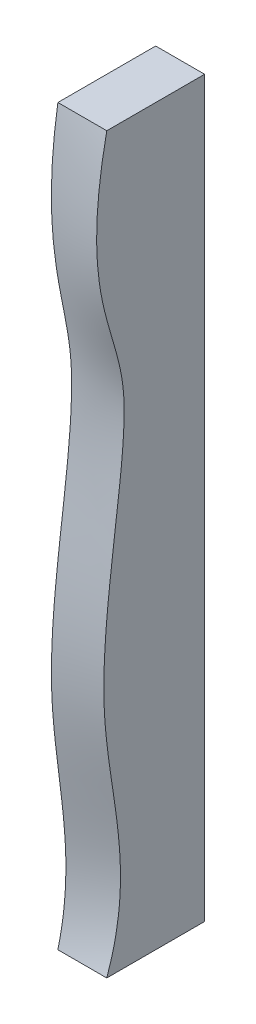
ISO-10303-21;
HEADER;
FILE_DESCRIPTION(('STEP AP214'),'2;1');
FILE_NAME('part.step','',(''),(''),'','','');
FILE_SCHEMA(('AUTOMOTIVE_DESIGN { 1 0 10303 214 1 1 1 1 }'));
ENDSEC;
DATA;
#1=APPLICATION_CONTEXT('core data for automotive mechanical design processes');
#2=APPLICATION_PROTOCOL_DEFINITION('international standard','automotive_design',2000,#1);
#3=PRODUCT_CONTEXT('',#1,'mechanical');
#4=PRODUCT('Part','Part','',(#3));
#5=PRODUCT_RELATED_PRODUCT_CATEGORY('part','',(#4));
#6=PRODUCT_DEFINITION_FORMATION('','',#4);
#7=PRODUCT_DEFINITION_CONTEXT('part definition',#1,'design');
#8=PRODUCT_DEFINITION('design','',#6,#7);
#9=PRODUCT_DEFINITION_SHAPE('','',#8);
#10=(LENGTH_UNIT() NAMED_UNIT(*) SI_UNIT(.MILLI.,.METRE.));
#11=(NAMED_UNIT(*) PLANE_ANGLE_UNIT() SI_UNIT($,.RADIAN.));
#12=(NAMED_UNIT(*) SI_UNIT($,.STERADIAN.) SOLID_ANGLE_UNIT());
#13=UNCERTAINTY_MEASURE_WITH_UNIT(LENGTH_MEASURE(1.E-05),#10,'distance_accuracy_value','');
#14=(GEOMETRIC_REPRESENTATION_CONTEXT(3) GLOBAL_UNCERTAINTY_ASSIGNED_CONTEXT((#13)) GLOBAL_UNIT_ASSIGNED_CONTEXT((#10,
#11,#12)) REPRESENTATION_CONTEXT('',''));
#15=CARTESIAN_POINT('',(0.,0.,0.));
#16=DIRECTION('',(0.,0.,1.));
#17=DIRECTION('',(1.,0.,0.));
#18=AXIS2_PLACEMENT_3D('',#15,#16,#17);
#19=CARTESIAN_POINT('',(-550.,375.,253.120113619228));
#20=DIRECTION('',(1.,0.,0.));
#21=DIRECTION('',(0.,0.,-1.));
#22=AXIS2_PLACEMENT_3D('',#19,#20,#21);
#23=PLANE('',#22);
#24=CARTESIAN_POINT('',(-550.,375.,100.));
#25=CARTESIAN_POINT('',(-550.,373.012969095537,100.416027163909));
#26=CARTESIAN_POINT('',(-550.,371.023877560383,100.822256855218));
#27=CARTESIAN_POINT('',(-550.,367.041408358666,101.614320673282));
#28=CARTESIAN_POINT('',(-550.,365.0480302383,102.000152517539));
#29=CARTESIAN_POINT('',(-550.,361.057166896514,102.750545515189));
#30=CARTESIAN_POINT('',(-550.,359.059681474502,103.115105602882));
#31=CARTESIAN_POINT('',(-550.,355.060777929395,103.822017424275));
#32=CARTESIAN_POINT('',(-550.,353.059359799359,104.164369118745));
#33=CARTESIAN_POINT('',(-550.,349.052754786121,104.825877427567));
#34=CARTESIAN_POINT('',(-550.,347.04756802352,105.145034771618));
#35=CARTESIAN_POINT('',(-550.,343.033579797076,105.759108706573));
#36=CARTESIAN_POINT('',(-550.,341.024778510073,106.054026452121));
#37=CARTESIAN_POINT('',(-550.,336.994968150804,106.619739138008));
#38=CARTESIAN_POINT('',(-550.,334.973943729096,106.890424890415));
#39=CARTESIAN_POINT('',(-550.,330.928505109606,107.405036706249));
#40=CARTESIAN_POINT('',(-550.,328.904090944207,107.648963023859));
#41=CARTESIAN_POINT('',(-550.,324.851993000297,108.108788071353));
#42=CARTESIAN_POINT('',(-550.,322.824309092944,108.32468566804));
#43=CARTESIAN_POINT('',(-550.,318.76578497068,108.727105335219));
#44=CARTESIAN_POINT('',(-550.,316.734944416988,108.913623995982));
#45=CARTESIAN_POINT('',(-550.,312.670208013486,109.255854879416));
#46=CARTESIAN_POINT('',(-550.,310.636311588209,109.411560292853));
#47=CARTESIAN_POINT('',(-550.,306.56557054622,109.69064719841));
#48=CARTESIAN_POINT('',(-550.,304.528725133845,109.814017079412));
#49=CARTESIAN_POINT('',(-550.,299.714061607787,110.065366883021));
#50=CARTESIAN_POINT('',(-550.,296.935464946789,110.178786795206));
#51=CARTESIAN_POINT('',(-550.,291.37566134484,110.338376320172));
#52=CARTESIAN_POINT('',(-550.,288.594453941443,110.384529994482));
#53=CARTESIAN_POINT('',(-550.,283.031982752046,110.40527152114));
#54=CARTESIAN_POINT('',(-550.,280.25071899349,110.379865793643));
#55=CARTESIAN_POINT('',(-550.,274.690705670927,110.253330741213));
#56=CARTESIAN_POINT('',(-550.,271.911955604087,110.152224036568));
#57=CARTESIAN_POINT('',(-550.,266.359554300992,109.870508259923));
#58=CARTESIAN_POINT('',(-550.,263.585901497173,109.68993025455));
#59=CARTESIAN_POINT('',(-550.,258.046195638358,109.24614352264));
#60=CARTESIAN_POINT('',(-550.,255.280140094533,108.982966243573));
#61=CARTESIAN_POINT('',(-550.,251.14140676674,108.525070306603));
#62=CARTESIAN_POINT('',(-550.,249.765145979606,108.362142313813));
#63=CARTESIAN_POINT('',(-550.,247.015298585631,108.015133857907));
#64=CARTESIAN_POINT('',(-550.,245.641711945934,107.831053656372));
#65=CARTESIAN_POINT('',(-550.,242.897306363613,107.441720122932));
#66=CARTESIAN_POINT('',(-550.,241.526487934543,107.236463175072));
#67=CARTESIAN_POINT('',(-550.,238.788157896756,106.8049656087));
#68=CARTESIAN_POINT('',(-550.,237.420646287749,106.578724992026));
#69=CARTESIAN_POINT('',(-550.,234.688862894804,106.105528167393));
#70=CARTESIAN_POINT('',(-550.,233.324592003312,105.858566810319));
#71=CARTESIAN_POINT('',(-550.,230.599855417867,105.344490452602));
#72=CARTESIAN_POINT('',(-550.,229.239389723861,105.077375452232));
#73=CARTESIAN_POINT('',(-550.,226.52206674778,104.523637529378));
#74=CARTESIAN_POINT('',(-550.,225.165210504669,104.237009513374));
#75=CARTESIAN_POINT('',(-550.,222.455543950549,103.645249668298));
#76=CARTESIAN_POINT('',(-550.,221.10273363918,103.34011784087));
#77=CARTESIAN_POINT('',(-550.,218.401041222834,102.712506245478));
#78=CARTESIAN_POINT('',(-550.,217.05215942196,102.390025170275));
#79=CARTESIAN_POINT('',(-550.,214.358301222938,101.729164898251));
#80=CARTESIAN_POINT('',(-550.,213.013324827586,101.390785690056));
#81=CARTESIAN_POINT('',(-550.,210.327620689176,100.699966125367));
#82=CARTESIAN_POINT('',(-550.,208.986891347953,100.347531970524));
#83=CARTESIAN_POINT('',(-550.,206.308724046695,99.630405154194));
#84=CARTESIAN_POINT('',(-550.,204.971286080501,99.2657125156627));
#85=CARTESIAN_POINT('',(-550.,202.604621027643,98.610788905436));
#86=CARTESIAN_POINT('',(-550.,201.574828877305,98.3225941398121));
#87=CARTESIAN_POINT('',(-550.,199.516875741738,97.7414039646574));
#88=CARTESIAN_POINT('',(-550.,198.488714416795,97.4484097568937));
#89=CARTESIAN_POINT('',(-550.,196.433574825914,96.8587782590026));
#90=CARTESIAN_POINT('',(-550.,195.406596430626,96.5621414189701));
#91=CARTESIAN_POINT('',(-550.,193.353350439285,95.9664622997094));
#92=CARTESIAN_POINT('',(-550.,192.327082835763,95.6674200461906));
#93=CARTESIAN_POINT('',(-550.,190.274981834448,95.0683037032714));
#94=CARTESIAN_POINT('',(-550.,189.249148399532,94.7682297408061));
#95=CARTESIAN_POINT('',(-550.,187.197324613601,94.168402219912));
#96=CARTESIAN_POINT('',(-550.,186.171334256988,93.8686486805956));
#97=CARTESIAN_POINT('',(-550.,184.118804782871,93.270931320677));
#98=CARTESIAN_POINT('',(-550.,183.092265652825,92.9729675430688));
#99=CARTESIAN_POINT('',(-550.,181.038234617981,92.3803407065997));
#100=CARTESIAN_POINT('',(-550.,180.010742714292,92.085677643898));
#101=CARTESIAN_POINT('',(-550.,177.954435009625,91.5012020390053));
#102=CARTESIAN_POINT('',(-550.,176.925619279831,91.2113892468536));
#103=CARTESIAN_POINT('',(-550.,174.866224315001,90.6381562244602));
#104=CARTESIAN_POINT('',(-550.,173.835645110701,90.3547358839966));
#105=CARTESIAN_POINT('',(-550.,171.771928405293,89.7957292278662));
#106=CARTESIAN_POINT('',(-550.,170.738790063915,89.5201460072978));
#107=CARTESIAN_POINT('',(-550.,168.669996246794,88.9784645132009));
#108=CARTESIAN_POINT('',(-550.,167.634340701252,88.7123665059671));
#109=CARTESIAN_POINT('',(-550.,165.211523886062,88.1035473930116));
#110=CARTESIAN_POINT('',(-550.,163.823270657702,87.7651497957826));
#111=CARTESIAN_POINT('',(-550.,161.041292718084,87.1114790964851));
#112=CARTESIAN_POINT('',(-550.,159.647567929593,86.7962063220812));
#113=CARTESIAN_POINT('',(-550.,156.854367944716,86.1920190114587));
#114=CARTESIAN_POINT('',(-550.,155.454892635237,85.9031049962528));
#115=CARTESIAN_POINT('',(-550.,152.651243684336,85.3547750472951));
#116=CARTESIAN_POINT('',(-550.,151.247074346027,85.0953371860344));
#117=CARTESIAN_POINT('',(-550.,148.433219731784,84.6082574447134));
#118=CARTESIAN_POINT('',(-550.,147.023534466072,84.3806155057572));
#119=CARTESIAN_POINT('',(-550.,144.199140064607,83.9592545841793));
#120=CARTESIAN_POINT('',(-550.,142.784431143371,83.7655341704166));
#121=CARTESIAN_POINT('',(-550.,140.303607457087,83.4574966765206));
#122=CARTESIAN_POINT('',(-550.,139.238450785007,83.3354211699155));
#123=CARTESIAN_POINT('',(-550.,137.105951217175,83.1118172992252));
#124=CARTESIAN_POINT('',(-550.,136.038608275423,83.0102893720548));
#125=CARTESIAN_POINT('',(-550.,133.902120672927,82.8282466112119));
#126=CARTESIAN_POINT('',(-550.,132.832975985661,82.7477320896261));
#127=CARTESIAN_POINT('',(-550.,130.693430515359,82.6062117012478));
#128=CARTESIAN_POINT('',(-550.,129.623029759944,82.5452054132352));
#129=CARTESIAN_POINT('',(-550.,127.480641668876,82.4410824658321));
#130=CARTESIAN_POINT('',(-550.,126.408653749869,82.3979779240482));
#131=CARTESIAN_POINT('',(-550.,124.264154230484,82.3282553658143));
#132=CARTESIAN_POINT('',(-550.,123.191642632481,82.3016372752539));
#133=CARTESIAN_POINT('',(-550.,121.046347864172,82.2634911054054));
#134=CARTESIAN_POINT('',(-550.,119.973564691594,82.2519631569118));
#135=CARTESIAN_POINT('',(-550.,117.827979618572,82.2426791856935));
#136=CARTESIAN_POINT('',(-550.,116.755177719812,82.2449227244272));
#137=CARTESIAN_POINT('',(-550.,114.254551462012,82.2647422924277));
#138=CARTESIAN_POINT('',(-550.,112.826765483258,82.2871481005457));
#139=CARTESIAN_POINT('',(-550.,109.971612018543,82.3513544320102));
#140=CARTESIAN_POINT('',(-550.,108.54424454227,82.3931553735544));
#141=CARTESIAN_POINT('',(-550.,106.403573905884,82.4684672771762));
#142=CARTESIAN_POINT('',(-550.,105.690041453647,82.4956748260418));
#143=CARTESIAN_POINT('',(-550.,104.263134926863,82.5539723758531));
#144=CARTESIAN_POINT('',(-550.,103.549760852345,82.5850623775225));
#145=CARTESIAN_POINT('',(-550.,101.409906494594,82.6838541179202));
#146=CARTESIAN_POINT('',(-550.,99.9836785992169,82.7570781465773));
#147=CARTESIAN_POINT('',(-550.,97.1314560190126,82.9170042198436));
#148=CARTESIAN_POINT('',(-550.,95.7054616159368,83.0037112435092));
#149=CARTESIAN_POINT('',(-550.,92.8542694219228,83.1893463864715));
#150=CARTESIAN_POINT('',(-550.,91.4290716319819,83.2882745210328));
#151=CARTESIAN_POINT('',(-550.,88.5789796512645,83.4972265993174));
#152=CARTESIAN_POINT('',(-550.,87.154085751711,83.6072545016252));
#153=CARTESIAN_POINT('',(-550.,84.3051072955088,83.8372850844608));
#154=CARTESIAN_POINT('',(-550.,82.8810227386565,83.9572877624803));
#155=CARTESIAN_POINT('',(-550.,78.6093714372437,84.3307492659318));
#156=CARTESIAN_POINT('',(-550.,75.7629738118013,84.597619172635));
#157=CARTESIAN_POINT('',(-550.,70.0731557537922,85.1596698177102));
#158=CARTESIAN_POINT('',(-550.,67.2297351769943,85.4548491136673));
#159=CARTESIAN_POINT('',(-550.,61.5345567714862,86.0683100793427));
#160=CARTESIAN_POINT('',(-550.,58.682807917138,86.3866746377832));
#161=CARTESIAN_POINT('',(-550.,52.9821269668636,87.0398917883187));
#162=CARTESIAN_POINT('',(-550.,50.1331942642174,87.3747391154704));
#163=CARTESIAN_POINT('',(-550.,44.4373976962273,88.0562462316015));
#164=CARTESIAN_POINT('',(-550.,41.5905335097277,88.4029033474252));
#165=CARTESIAN_POINT('',(-550.,35.8982137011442,89.1040476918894));
#166=CARTESIAN_POINT('',(-550.,33.0527579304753,89.4585337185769));
#167=CARTESIAN_POINT('',(-550.,27.362662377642,90.1719029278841));
#168=CARTESIAN_POINT('',(-550.,24.5180225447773,90.5307857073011));
#169=CARTESIAN_POINT('',(-550.,18.8290164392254,91.2499197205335));
#170=CARTESIAN_POINT('',(-550.,15.9846501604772,91.6101709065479));
#171=CARTESIAN_POINT('',(-550.,9.60036426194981,92.417165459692));
#172=CARTESIAN_POINT('',(-550.,6.06039571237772,92.8635232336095));
#173=CARTESIAN_POINT('',(-550.,-1.02064176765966,93.7490217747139));
#174=CARTESIAN_POINT('',(-550.,-4.56171074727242,94.1881621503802));
#175=CARTESIAN_POINT('',(-550.,-11.6456639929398,95.054267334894));
#176=CARTESIAN_POINT('',(-550.,-15.1885483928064,95.4812310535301));
#177=CARTESIAN_POINT('',(-550.,-22.2768592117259,96.3179285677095));
#178=CARTESIAN_POINT('',(-550.,-25.8222859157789,96.7276599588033));
#179=CARTESIAN_POINT('',(-550.,-32.9164316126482,97.5246418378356));
#180=CARTESIAN_POINT('',(-550.,-36.465151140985,97.9118875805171));
#181=CARTESIAN_POINT('',(-550.,-43.5666638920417,98.6583879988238));
#182=CARTESIAN_POINT('',(-550.,-47.1194580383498,99.0176339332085));
#183=CARTESIAN_POINT('',(-550.,-54.2010528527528,99.6995367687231));
#184=CARTESIAN_POINT('',(-550.,-57.7298283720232,100.02245334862));
#185=CARTESIAN_POINT('',(-550.,-64.791037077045,100.628829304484));
#186=CARTESIAN_POINT('',(-550.,-68.3234704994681,100.912285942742));
#187=CARTESIAN_POINT('',(-550.,-75.3911648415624,101.433253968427));
#188=CARTESIAN_POINT('',(-550.,-78.9264251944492,101.670772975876));
#189=CARTESIAN_POINT('',(-550.,-85.9989546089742,102.092986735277));
#190=CARTESIAN_POINT('',(-550.,-89.5362226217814,102.277698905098));
#191=CARTESIAN_POINT('',(-550.,-96.6120250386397,102.586951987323));
#192=CARTESIAN_POINT('',(-550.,-100.150558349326,102.711517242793));
#193=CARTESIAN_POINT('',(-550.,-105.45899665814,102.847265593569));
#194=CARTESIAN_POINT('',(-550.,-107.228269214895,102.883996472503));
#195=CARTESIAN_POINT('',(-550.,-110.767105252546,102.939361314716));
#196=CARTESIAN_POINT('',(-550.,-112.536668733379,102.957995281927));
#197=CARTESIAN_POINT('',(-550.,-116.121179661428,102.976275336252));
#198=CARTESIAN_POINT('',(-550.,-117.936129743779,102.975423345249));
#199=CARTESIAN_POINT('',(-550.,-121.565902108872,102.952229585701));
#200=CARTESIAN_POINT('',(-550.,-123.380724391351,102.929887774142));
#201=CARTESIAN_POINT('',(-550.,-127.010146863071,102.862369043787));
#202=CARTESIAN_POINT('',(-550.,-128.82474700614,102.817189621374));
#203=CARTESIAN_POINT('',(-550.,-132.453189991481,102.702579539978));
#204=CARTESIAN_POINT('',(-550.,-134.267032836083,102.633148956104));
#205=CARTESIAN_POINT('',(-550.,-136.987039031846,102.509688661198));
#206=CARTESIAN_POINT('',(-550.,-137.893648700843,102.465312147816));
#207=CARTESIAN_POINT('',(-550.,-139.706520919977,102.369924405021));
#208=CARTESIAN_POINT('',(-550.,-140.612783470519,102.318913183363));
#209=CARTESIAN_POINT('',(-550.,-141.971866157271,102.237273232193));
#210=CARTESIAN_POINT('',(-550.,-142.424841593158,102.209206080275));
#211=CARTESIAN_POINT('',(-550.,-143.330681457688,102.151334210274));
#212=CARTESIAN_POINT('',(-550.,-143.783545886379,102.121529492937));
#213=CARTESIAN_POINT('',(-550.,-145.141967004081,102.029581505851));
#214=CARTESIAN_POINT('',(-550.,-146.047352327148,101.964904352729));
#215=CARTESIAN_POINT('',(-550.,-148.76339871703,101.761358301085));
#216=CARTESIAN_POINT('',(-550.,-150.573356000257,101.613011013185));
#217=CARTESIAN_POINT('',(-550.,-153.286842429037,101.374220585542));
#218=CARTESIAN_POINT('',(-550.,-154.191102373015,101.291911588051));
#219=CARTESIAN_POINT('',(-550.,-155.999159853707,101.122352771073));
#220=CARTESIAN_POINT('',(-550.,-156.902957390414,101.035102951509));
#221=CARTESIAN_POINT('',(-550.,-159.61410714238,100.766372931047));
#222=CARTESIAN_POINT('',(-550.,-161.420774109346,100.577951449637));
#223=CARTESIAN_POINT('',(-550.,-165.032270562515,100.184426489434));
#224=CARTESIAN_POINT('',(-550.,-166.837100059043,99.9793231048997));
#225=CARTESIAN_POINT('',(-550.,-170.444765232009,99.5543820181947));
#226=CARTESIAN_POINT('',(-550.,-172.247601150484,99.3345463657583));
#227=CARTESIAN_POINT('',(-550.,-175.851660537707,98.882043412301));
#228=CARTESIAN_POINT('',(-550.,-177.652884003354,98.6493760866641));
#229=CARTESIAN_POINT('',(-550.,-181.269005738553,98.1711720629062));
#230=CARTESIAN_POINT('',(-550.,-183.083891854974,97.925543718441));
#231=CARTESIAN_POINT('',(-550.,-186.712417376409,97.4252746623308));
#232=CARTESIAN_POINT('',(-550.,-188.526056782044,97.1706339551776));
#233=CARTESIAN_POINT('',(-550.,-193.964457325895,96.3964334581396));
#234=CARTESIAN_POINT('',(-550.,-197.587730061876,95.8664568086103));
#235=CARTESIAN_POINT('',(-550.,-204.832067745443,94.7957005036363));
#236=CARTESIAN_POINT('',(-550.,-208.453132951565,94.2549225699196));
#237=CARTESIAN_POINT('',(-550.,-215.695960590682,93.1799154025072));
#238=CARTESIAN_POINT('',(-550.,-219.317722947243,92.6456856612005));
#239=CARTESIAN_POINT('',(-550.,-226.564897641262,91.6015786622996));
#240=CARTESIAN_POINT('',(-550.,-230.190310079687,91.091702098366));
#241=CARTESIAN_POINT('',(-550.,-237.447824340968,90.1144851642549));
#242=CARTESIAN_POINT('',(-550.,-241.07992754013,89.6471548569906));
#243=CARTESIAN_POINT('',(-550.,-247.379905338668,88.8904634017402));
#244=CARTESIAN_POINT('',(-550.,-250.046066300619,88.5869171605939));
#245=CARTESIAN_POINT('',(-550.,-255.383159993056,88.0200123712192));
#246=CARTESIAN_POINT('',(-550.,-258.054093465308,87.7566607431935));
#247=CARTESIAN_POINT('',(-550.,-263.400204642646,87.2775047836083));
#248=CARTESIAN_POINT('',(-550.,-266.07538225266,87.0616994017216));
#249=CARTESIAN_POINT('',(-550.,-271.429441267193,86.684788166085));
#250=CARTESIAN_POINT('',(-550.,-274.108322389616,86.5236783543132));
#251=CARTESIAN_POINT('',(-550.,-279.469224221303,86.2630170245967));
#252=CARTESIAN_POINT('',(-550.,-282.151245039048,86.1634677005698));
#253=CARTESIAN_POINT('',(-550.,-287.517835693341,86.0324091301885));
#254=CARTESIAN_POINT('',(-550.,-290.202406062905,86.0009210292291));
#255=CARTESIAN_POINT('',(-550.,-295.546955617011,86.0119545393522));
#256=CARTESIAN_POINT('',(-550.,-298.206935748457,86.0538036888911));
#257=CARTESIAN_POINT('',(-550.,-303.525392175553,86.215367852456));
#258=CARTESIAN_POINT('',(-550.,-306.183867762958,86.3351066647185));
#259=CARTESIAN_POINT('',(-550.,-311.49569512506,86.6567859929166));
#260=CARTESIAN_POINT('',(-550.,-314.149047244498,86.8587207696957));
#261=CARTESIAN_POINT('',(-550.,-319.447104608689,87.3481198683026));
#262=CARTESIAN_POINT('',(-550.,-322.091812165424,87.6355590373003));
#263=CARTESIAN_POINT('',(-550.,-327.369124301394,88.2982329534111));
#264=CARTESIAN_POINT('',(-550.,-330.001733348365,88.6734320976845));
#265=CARTESIAN_POINT('',(-550.,-335.251593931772,89.5128537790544));
#266=CARTESIAN_POINT('',(-550.,-337.868851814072,89.9770363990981));
#267=CARTESIAN_POINT('',(-550.,-341.64560977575,90.7137968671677));
#268=CARTESIAN_POINT('',(-550.,-342.812173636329,90.9506732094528));
#269=CARTESIAN_POINT('',(-550.,-345.141413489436,91.4422780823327));
#270=CARTESIAN_POINT('',(-550.,-346.304089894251,91.6970046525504));
#271=CARTESIAN_POINT('',(-550.,-348.625307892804,92.2242344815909));
#272=CARTESIAN_POINT('',(-550.,-349.783849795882,92.4967363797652));
#273=CARTESIAN_POINT('',(-550.,-352.096581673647,93.0594062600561));
#274=CARTESIAN_POINT('',(-550.,-353.250771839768,93.3495734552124));
#275=CARTESIAN_POINT('',(-550.,-355.554585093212,93.9474300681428));
#276=CARTESIAN_POINT('',(-550.,-356.70420825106,94.2551192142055));
#277=CARTESIAN_POINT('',(-550.,-359.007640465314,94.8903145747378));
#278=CARTESIAN_POINT('',(-550.,-360.161411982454,95.2179569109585));
#279=CARTESIAN_POINT('',(-550.,-362.463896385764,95.8906472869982));
#280=CARTESIAN_POINT('',(-550.,-363.612609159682,96.2356957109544));
#281=CARTESIAN_POINT('',(-550.,-365.904779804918,96.9429571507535));
#282=CARTESIAN_POINT('',(-550.,-367.048237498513,97.3051707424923));
#283=CARTESIAN_POINT('',(-550.,-369.329708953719,98.046495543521));
#284=CARTESIAN_POINT('',(-550.,-370.467722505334,98.4256073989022));
#285=CARTESIAN_POINT('',(-550.,-372.738129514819,99.2004309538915));
#286=CARTESIAN_POINT('',(-550.,-373.870522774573,99.5961432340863));
#287=CARTESIAN_POINT('',(-550.,-375.,100.));
#288=B_SPLINE_CURVE_WITH_KNOTS('',3,(#24,#25,#26,#27,#28,#29,#30,#31,#32,#33,#34,#35,#36,#37,
#38,#39,#40,#41,#42,#43,#44,#45,#46,#47,#48,#49,#50,#51,#52,#53,#54,#55,#56,#57,#58,#59,#60,#61,
#62,#63,#64,#65,#66,#67,#68,#69,#70,#71,#72,#73,#74,#75,#76,#77,#78,#79,#80,#81,#82,#83,#84,#85,
#86,#87,#88,#89,#90,#91,#92,#93,#94,#95,#96,#97,#98,#99,#100,#101,#102,#103,#104,#105,#106,#107,
#108,#109,#110,#111,#112,#113,#114,#115,#116,#117,#118,#119,#120,#121,#122,#123,#124,#125,#126,
#127,#128,#129,#130,#131,#132,#133,#134,#135,#136,#137,#138,#139,#140,#141,#142,#143,#144,#145,
#146,#147,#148,#149,#150,#151,#152,#153,#154,#155,#156,#157,#158,#159,#160,#161,#162,#163,#164,
#165,#166,#167,#168,#169,#170,#171,#172,#173,#174,#175,#176,#177,#178,#179,#180,#181,#182,#183,
#184,#185,#186,#187,#188,#189,#190,#191,#192,#193,#194,#195,#196,#197,#198,#199,#200,#201,#202,
#203,#204,#205,#206,#207,#208,#209,#210,#211,#212,#213,#214,#215,#216,#217,#218,#219,#220,#221,
#222,#223,#224,#225,#226,#227,#228,#229,#230,#231,#232,#233,#234,#235,#236,#237,#238,#239,#240,
#241,#242,#243,#244,#245,#246,#247,#248,#249,#250,#251,#252,#253,#254,#255,#256,#257,#258,#259,
#260,#261,#262,#263,#264,#265,#266,#267,#268,#269,#270,#271,#272,#273,#274,#275,#276,#277,#278,
#279,#280,#281,#282,#283,#284,#285,#286,#287),.UNSPECIFIED.,.F.,.F.,(4,2,2,2,2,2,2,2,2,2,2,2,2,
2,2,2,2,2,2,2,2,2,2,2,2,2,2,2,2,2,2,2,2,2,2,2,2,2,2,2,2,2,2,2,2,2,2,2,2,2,2,2,2,2,2,2,2,2,2,2,2,
2,2,2,2,2,2,2,2,2,2,2,2,2,2,2,2,2,2,2,2,2,2,2,2,2,2,2,2,2,2,2,2,2,2,2,2,2,2,2,2,2,2,2,2,2,2,2,2,
2,2,2,2,2,2,2,2,2,2,2,2,2,2,2,2,2,2,2,2,2,2,4),(0.,6.09033635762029,12.1813527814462,
18.2726740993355,24.3640061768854,30.4551465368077,36.5459965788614,42.6630388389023,
48.7800229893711,54.8972543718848,61.0151951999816,67.1344864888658,73.2559721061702,
81.5979084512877,89.9418210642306,98.284985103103,106.625657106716,114.96307149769,
123.297315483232,127.454794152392,131.612221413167,135.770359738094,139.928497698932,
144.08767203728,148.24684631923,152.40711047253,156.567374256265,160.727951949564,
164.888532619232,169.04729734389,173.206054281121,176.414117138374,179.621388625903,
182.828267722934,186.03511259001,189.241576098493,192.448221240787,195.654943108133,
198.861661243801,202.068213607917,205.274710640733,208.482456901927,211.69029314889,
215.976824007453,220.263415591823,224.550091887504,228.833558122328,233.117016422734,
237.400293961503,240.616498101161,243.832770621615,247.049090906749,250.265341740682,
253.483766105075,256.702176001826,259.920613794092,263.138949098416,267.422676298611,
271.706495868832,273.848639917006,275.99078436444,280.275026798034,284.5608551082,
288.846688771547,293.134056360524,297.421422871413,305.99786075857,314.573861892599,
323.182189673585,331.787785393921,340.391446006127,348.993794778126,357.595360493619,
366.196628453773,376.900621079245,387.605192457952,398.310719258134,409.017734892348,
419.727001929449,430.439599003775,441.069970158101,451.70107847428,462.330421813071,
472.956255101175,483.577784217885,488.886669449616,494.195553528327,499.640285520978,
505.085028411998,510.530368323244,515.975691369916,518.698757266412,521.421819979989,
522.783349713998,524.144878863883,526.867934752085,532.315832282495,535.039817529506,
537.763802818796,543.213105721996,548.662377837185,554.110893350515,559.559419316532,
565.05368895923,570.547955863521,581.53337414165,592.51705509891,603.499879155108,
614.483015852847,625.468743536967,633.518652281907,641.56994539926,649.621060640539,
657.671593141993,665.722412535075,673.77573281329,681.755594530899,689.737895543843,
697.719639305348,705.699037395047,713.675203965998,721.647800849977,725.218802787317,
728.789413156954,732.359750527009,735.929928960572,739.500052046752,743.09808593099,
746.696199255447,750.294433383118,753.892805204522,757.491302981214),.UNSPECIFIED.);
#289=CARTESIAN_POINT('',(-550.,375.,100.));
#290=VERTEX_POINT('',#289);
#291=CARTESIAN_POINT('',(-550.,-375.,100.));
#292=VERTEX_POINT('',#291);
#293=EDGE_CURVE('E88',#290,#292,#288,.T.);
#294=ORIENTED_EDGE('',*,*,#293,.T.);
#295=DIRECTION('',(0.,0.,-1.));
#296=VECTOR('',#295,1.);
#297=CARTESIAN_POINT('',(-550.,-375.,253.120113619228));
#298=LINE('',#297,#296);
#299=CARTESIAN_POINT('',(-550.,-375.,0.));
#300=VERTEX_POINT('',#299);
#301=EDGE_CURVE('E50',#292,#300,#298,.T.);
#302=ORIENTED_EDGE('',*,*,#301,.T.);
#303=DIRECTION('',(0.,-1.,0.));
#304=VECTOR('',#303,1.);
#305=CARTESIAN_POINT('',(-550.,375.,0.));
#306=LINE('',#305,#304);
#307=CARTESIAN_POINT('',(-550.,375.,0.));
#308=VERTEX_POINT('',#307);
#309=EDGE_CURVE('E87',#308,#300,#306,.T.);
#310=ORIENTED_EDGE('',*,*,#309,.F.);
#311=DIRECTION('',(0.,0.,-1.));
#312=VECTOR('',#311,1.);
#313=CARTESIAN_POINT('',(-550.,375.,253.120113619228));
#314=LINE('',#313,#312);
#315=EDGE_CURVE('E65',#290,#308,#314,.T.);
#316=ORIENTED_EDGE('',*,*,#315,.F.);
#317=EDGE_LOOP('',(#294,#302,#310,#316));
#318=FACE_BOUND('',#317,.T.);
#319=ADVANCED_FACE('F35',(#318),#23,.T.);
#320=CARTESIAN_POINT('',(0.,0.,0.));
#321=DIRECTION('',(0.,0.,-1.));
#322=DIRECTION('',(-1.,0.,0.));
#323=AXIS2_PLACEMENT_3D('',#320,#321,#322);
#324=PLANE('',#323);
#325=DIRECTION('',(1.,0.,0.));
#326=VECTOR('',#325,1.);
#327=CARTESIAN_POINT('',(-750.,-375.,0.));
#328=LINE('',#327,#326);
#329=CARTESIAN_POINT('',(-600.,-375.,0.));
#330=VERTEX_POINT('',#329);
#331=EDGE_CURVE('E79',#330,#300,#328,.T.);
#332=ORIENTED_EDGE('',*,*,#331,.F.);
#333=DIRECTION('',(0.,1.,0.));
#334=VECTOR('',#333,1.);
#335=CARTESIAN_POINT('',(-600.,375.,0.));
#336=LINE('',#335,#334);
#337=CARTESIAN_POINT('',(-600.,375.,0.));
#338=VERTEX_POINT('',#337);
#339=EDGE_CURVE('E157',#330,#338,#336,.T.);
#340=ORIENTED_EDGE('',*,*,#339,.T.);
#341=DIRECTION('',(-1.,0.,0.));
#342=VECTOR('',#341,1.);
#343=CARTESIAN_POINT('',(-750.,375.,0.));
#344=LINE('',#343,#342);
#345=EDGE_CURVE('E93',#308,#338,#344,.T.);
#346=ORIENTED_EDGE('',*,*,#345,.F.);
#347=ORIENTED_EDGE('',*,*,#309,.T.);
#348=EDGE_LOOP('',(#332,#340,#346,#347));
#349=FACE_BOUND('',#348,.T.);
#350=ADVANCED_FACE('F91',(#349),#324,.T.);
#351=CARTESIAN_POINT('',(750.,-375.,100.));
#352=CARTESIAN_POINT('',(750.,-302.078506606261,100.));
#353=CARTESIAN_POINT('',(750.,-224.483786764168,100.));
#354=CARTESIAN_POINT('',(750.,-61.5160152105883,100.));
#355=CARTESIAN_POINT('',(750.,39.4445673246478,100.));
#356=CARTESIAN_POINT('',(750.,211.849847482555,100.));
#357=CARTESIAN_POINT('',(750.,298.882075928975,100.));
#358=CARTESIAN_POINT('',(750.,375.,100.));
#359=CARTESIAN_POINT('',(669.085175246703,-375.,100.));
#360=CARTESIAN_POINT('',(669.085175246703,-302.078506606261,100.));
#361=CARTESIAN_POINT('',(669.085175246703,-234.282472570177,121.198481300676));
#362=CARTESIAN_POINT('',(669.085175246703,-62.2283080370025,120.288550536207));
#363=CARTESIAN_POINT('',(669.085175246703,68.0647781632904,82.7868169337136));
#364=CARTESIAN_POINT('',(669.085175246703,240.312514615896,73.0426687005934));
#365=CARTESIAN_POINT('',(669.085175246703,298.882075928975,100.));
#366=CARTESIAN_POINT('',(669.085175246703,375.,100.));
#367=CARTESIAN_POINT('',(500.445116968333,-375.,100.));
#368=CARTESIAN_POINT('',(517.991528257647,-284.627602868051,95.5040591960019));
#369=CARTESIAN_POINT('',(530.038001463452,-221.673003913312,150.719602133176));
#370=CARTESIAN_POINT('',(473.74510655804,-71.7416270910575,167.060530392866));
#371=CARTESIAN_POINT('',(387.213321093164,45.6135081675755,91.591323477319));
#372=CARTESIAN_POINT('',(378.694107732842,207.638743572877,66.6461848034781));
#373=CARTESIAN_POINT('',(433.17831170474,253.396603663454,122.492891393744));
#374=CARTESIAN_POINT('',(500.445116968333,375.,100.));
#375=CARTESIAN_POINT('',(285.091607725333,-375.,100.));
#376=CARTESIAN_POINT('',(309.270321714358,-264.297524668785,86.4064578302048));
#377=CARTESIAN_POINT('',(325.856840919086,-200.08226970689,164.07204721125));
#378=CARTESIAN_POINT('',(247.47112957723,-80.9425320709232,234.992870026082));
#379=CARTESIAN_POINT('',(127.240382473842,2.40271344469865,186.756001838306));
#380=CARTESIAN_POINT('',(115.567806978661,152.518027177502,151.057444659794));
#381=CARTESIAN_POINT('',(191.428893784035,202.025100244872,189.039851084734));
#382=CARTESIAN_POINT('',(285.091607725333,375.,100.));
#383=CARTESIAN_POINT('',(47.4554331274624,-375.,100.));
#384=CARTESIAN_POINT('',(51.0669239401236,-278.639867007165,99.5141662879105));
#385=CARTESIAN_POINT('',(52.9210710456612,-231.452124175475,201.325948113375));
#386=CARTESIAN_POINT('',(3.18149891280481,-90.8615864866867,272.445475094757));
#387=CARTESIAN_POINT('',(-61.0346058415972,45.7948958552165,186.157760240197));
#388=CARTESIAN_POINT('',(-59.6612105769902,205.286893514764,133.941969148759));
#389=CARTESIAN_POINT('',(-11.8049718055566,220.40073671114,189.8209162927));
#390=CARTESIAN_POINT('',(47.4554331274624,375.,100.));
#391=CARTESIAN_POINT('',(-175.903454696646,-375.,100.));
#392=CARTESIAN_POINT('',(-199.823715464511,-320.588060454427,126.731848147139));
#393=CARTESIAN_POINT('',(-216.967937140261,-300.821135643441,242.921959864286));
#394=CARTESIAN_POINT('',(-184.265304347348,-55.1410097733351,206.147478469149));
#395=CARTESIAN_POINT('',(-119.865061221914,249.096629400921,-32.5779079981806));
#396=CARTESIAN_POINT('',(-104.641938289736,431.262460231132,-94.4845569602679));
#397=CARTESIAN_POINT('',(-136.623034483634,348.137040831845,60.785640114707));
#398=CARTESIAN_POINT('',(-175.903454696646,375.,100.));
#399=CARTESIAN_POINT('',(-355.235514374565,-375.,100.));
#400=CARTESIAN_POINT('',(-319.200833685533,-282.590755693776,58.2859511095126));
#401=CARTESIAN_POINT('',(-293.075279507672,-226.888141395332,104.97090627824));
#402=CARTESIAN_POINT('',(-324.119079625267,-68.6572837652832,122.102733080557));
#403=CARTESIAN_POINT('',(-398.972481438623,73.039345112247,53.3701087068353));
#404=CARTESIAN_POINT('',(-423.398679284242,233.384819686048,47.4380317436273));
#405=CARTESIAN_POINT('',(-392.720188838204,253.575952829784,124.952096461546));
#406=CARTESIAN_POINT('',(-355.235514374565,375.,100.));
#407=CARTESIAN_POINT('',(-536.684515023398,-375.,100.));
#408=CARTESIAN_POINT('',(-494.827225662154,-277.129657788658,52.0422385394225));
#409=CARTESIAN_POINT('',(-464.573647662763,-205.017596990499,67.039018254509));
#410=CARTESIAN_POINT('',(-506.334367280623,-72.2467511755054,96.5036749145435));
#411=CARTESIAN_POINT('',(-600.216684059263,9.35641022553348,95.9941925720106));
#412=CARTESIAN_POINT('',(-628.122542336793,166.946160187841,106.349064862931));
#413=CARTESIAN_POINT('',(-587.011939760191,237.095914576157,138.331902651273));
#414=CARTESIAN_POINT('',(-536.684515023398,375.,100.));
#415=CARTESIAN_POINT('',(-644.685568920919,-375.,100.));
#416=CARTESIAN_POINT('',(-644.685568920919,-302.078506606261,100.));
#417=CARTESIAN_POINT('',(-644.685568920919,-237.237234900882,127.59081546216));
#418=CARTESIAN_POINT('',(-644.685568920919,-62.4430976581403,126.406497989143));
#419=CARTESIAN_POINT('',(-644.685568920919,76.6951111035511,77.5962366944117));
#420=CARTESIAN_POINT('',(-644.685568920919,248.895340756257,64.9137717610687));
#421=CARTESIAN_POINT('',(-644.685568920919,298.882075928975,100.));
#422=CARTESIAN_POINT('',(-644.685568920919,375.,100.));
#423=CARTESIAN_POINT('',(-750.,-375.,100.));
#424=CARTESIAN_POINT('',(-750.,-302.078506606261,100.));
#425=CARTESIAN_POINT('',(-750.,-224.483786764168,100.));
#426=CARTESIAN_POINT('',(-750.,-61.5160152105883,100.));
#427=CARTESIAN_POINT('',(-750.,39.4445673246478,100.));
#428=CARTESIAN_POINT('',(-750.,211.849847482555,100.));
#429=CARTESIAN_POINT('',(-750.,298.882075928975,100.));
#430=CARTESIAN_POINT('',(-750.,375.,100.));
#431=B_SPLINE_SURFACE_WITH_KNOTS('',3,3,((#351,#352,#353,#354,#355,#356,#357,#358),(#359,#360,
#361,#362,#363,#364,#365,#366),(#367,#368,#369,#370,#371,#372,#373,#374),(#375,#376,#377,#378,
#379,#380,#381,#382),(#383,#384,#385,#386,#387,#388,#389,#390),(#391,#392,#393,#394,#395,#396,
#397,#398),(#399,#400,#401,#402,#403,#404,#405,#406),(#407,#408,#409,#410,#411,#412,#413,#414),
(#415,#416,#417,#418,#419,#420,#421,#422),(#423,#424,#425,#426,#427,#428,#429,#430)),
.UNSPECIFIED.,.F.,.F.,.F.,(4,1,1,1,1,1,1,4),(4,1,1,1,1,4),(0.,0.161829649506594,
0.33728011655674,0.430707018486,0.637101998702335,0.783997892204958,0.789371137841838,1.),(0.,
0.291685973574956,0.310378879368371,0.65187108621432,0.695528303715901,1.),.UNSPECIFIED.);
#432=CARTESIAN_POINT('',(-600.,-375.,100.));
#433=CARTESIAN_POINT('',(-600.,-373.3395006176,99.577223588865));
#434=CARTESIAN_POINT('',(-600.,-371.674716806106,99.1712815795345));
#435=CARTESIAN_POINT('',(-600.,-368.337292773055,98.3931439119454));
#436=CARTESIAN_POINT('',(-600.,-366.664652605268,98.0209480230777));
#437=CARTESIAN_POINT('',(-600.,-363.314579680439,97.3108775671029));
#438=CARTESIAN_POINT('',(-600.,-361.6371570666,96.9729551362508));
#439=CARTESIAN_POINT('',(-600.,-358.275886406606,96.3307420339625));
#440=CARTESIAN_POINT('',(-600.,-356.592038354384,96.0264513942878));
#441=CARTESIAN_POINT('',(-600.,-353.219901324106,95.451500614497));
#442=CARTESIAN_POINT('',(-600.,-351.531616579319,95.1808156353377));
#443=CARTESIAN_POINT('',(-600.,-348.150053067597,94.6724540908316));
#444=CARTESIAN_POINT('',(-600.,-346.456774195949,94.4347782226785));
#445=CARTESIAN_POINT('',(-600.,-343.066277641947,93.9919966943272));
#446=CARTESIAN_POINT('',(-600.,-341.369060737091,93.786885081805));
#447=CARTESIAN_POINT('',(-600.,-337.971065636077,93.4085533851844));
#448=CARTESIAN_POINT('',(-600.,-336.270287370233,93.2353339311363));
#449=CARTESIAN_POINT('',(-600.,-331.208727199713,92.7666140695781));
#450=CARTESIAN_POINT('',(-600.,-327.843674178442,92.5162220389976));
#451=CARTESIAN_POINT('',(-600.,-321.106496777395,92.1297930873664));
#452=CARTESIAN_POINT('',(-600.,-317.734371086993,91.9937796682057));
#453=CARTESIAN_POINT('',(-600.,-310.987395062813,91.827518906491));
#454=CARTESIAN_POINT('',(-600.,-307.612544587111,91.7972774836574));
#455=CARTESIAN_POINT('',(-600.,-300.864656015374,91.8326720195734));
#456=CARTESIAN_POINT('',(-600.,-297.491617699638,91.8982742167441));
#457=CARTESIAN_POINT('',(-600.,-289.65402958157,92.1496017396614));
#458=CARTESIAN_POINT('',(-600.,-285.190520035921,92.3674029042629));
#459=CARTESIAN_POINT('',(-600.,-276.272188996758,92.9254629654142));
#460=CARTESIAN_POINT('',(-600.,-271.817366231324,93.2657023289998));
#461=CARTESIAN_POINT('',(-600.,-262.914084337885,94.0412935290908));
#462=CARTESIAN_POINT('',(-600.,-258.465629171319,94.4766898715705));
#463=CARTESIAN_POINT('',(-600.,-249.572845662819,95.4152658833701));
#464=CARTESIAN_POINT('',(-600.,-245.128522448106,95.9184931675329));
#465=CARTESIAN_POINT('',(-600.,-236.241768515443,96.965729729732));
#466=CARTESIAN_POINT('',(-600.,-231.799341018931,97.5097658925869));
#467=CARTESIAN_POINT('',(-600.,-222.914221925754,98.6122452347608));
#468=CARTESIAN_POINT('',(-600.,-218.471531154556,99.1706949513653));
#469=CARTESIAN_POINT('',(-600.,-209.580925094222,100.276838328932));
#470=CARTESIAN_POINT('',(-600.,-205.133008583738,100.824522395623));
#471=CARTESIAN_POINT('',(-600.,-198.458555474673,101.619259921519));
#472=CARTESIAN_POINT('',(-600.,-196.233618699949,101.879673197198));
#473=CARTESIAN_POINT('',(-600.,-191.78238616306,102.388668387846));
#474=CARTESIAN_POINT('',(-600.,-189.556090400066,102.637250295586));
#475=CARTESIAN_POINT('',(-600.,-185.103339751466,103.119544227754));
#476=CARTESIAN_POINT('',(-600.,-182.876885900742,103.353265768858));
#477=CARTESIAN_POINT('',(-600.,-178.422207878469,103.803209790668));
#478=CARTESIAN_POINT('',(-600.,-176.193983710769,104.019432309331));
#479=CARTESIAN_POINT('',(-600.,-171.737470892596,104.431476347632));
#480=CARTESIAN_POINT('',(-600.,-169.509183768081,104.627314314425));
#481=CARTESIAN_POINT('',(-600.,-165.050689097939,104.996128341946));
#482=CARTESIAN_POINT('',(-600.,-162.820481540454,105.169104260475));
#483=CARTESIAN_POINT('',(-600.,-159.4745894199,105.40943371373));
#484=CARTESIAN_POINT('',(-600.,-158.359585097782,105.486330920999));
#485=CARTESIAN_POINT('',(-600.,-156.129133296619,105.633443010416));
#486=CARTESIAN_POINT('',(-600.,-155.013685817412,105.703657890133));
#487=CARTESIAN_POINT('',(-600.,-152.782367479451,105.836821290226));
#488=CARTESIAN_POINT('',(-600.,-151.666496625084,105.89976988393));
#489=CARTESIAN_POINT('',(-600.,-149.434341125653,106.017847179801));
#490=CARTESIAN_POINT('',(-600.,-148.318056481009,106.072975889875));
#491=CARTESIAN_POINT('',(-600.,-146.085325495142,106.174849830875));
#492=CARTESIAN_POINT('',(-600.,-144.968879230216,106.221596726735));
#493=CARTESIAN_POINT('',(-600.,-142.735649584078,106.30619928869));
#494=CARTESIAN_POINT('',(-600.,-141.618866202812,106.344054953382));
#495=CARTESIAN_POINT('',(-600.,-139.385035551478,106.411193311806));
#496=CARTESIAN_POINT('',(-600.,-138.267988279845,106.440475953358));
#497=CARTESIAN_POINT('',(-600.,-136.033709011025,106.490757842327));
#498=CARTESIAN_POINT('',(-600.,-134.916477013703,106.511757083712));
#499=CARTESIAN_POINT('',(-600.,-131.563873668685,106.562771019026));
#500=CARTESIAN_POINT('',(-600.,-129.328310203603,106.580780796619));
#501=CARTESIAN_POINT('',(-600.,-124.85715921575,106.58695967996));
#502=CARTESIAN_POINT('',(-600.,-122.621571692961,106.575128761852));
#503=CARTESIAN_POINT('',(-600.,-118.148958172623,106.523632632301));
#504=CARTESIAN_POINT('',(-600.,-115.911932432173,106.483945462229));
#505=CARTESIAN_POINT('',(-600.,-111.438502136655,106.378624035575));
#506=CARTESIAN_POINT('',(-600.,-109.202097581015,106.312989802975));
#507=CARTESIAN_POINT('',(-600.,-104.728314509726,106.157514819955));
#508=CARTESIAN_POINT('',(-600.,-102.490936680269,106.067654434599));
#509=CARTESIAN_POINT('',(-600.,-98.0172066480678,105.865459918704));
#510=CARTESIAN_POINT('',(-600.,-95.7808544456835,105.7531257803));
#511=CARTESIAN_POINT('',(-600.,-89.0707293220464,105.384721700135));
#512=CARTESIAN_POINT('',(-600.,-84.59865403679,105.097350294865));
#513=CARTESIAN_POINT('',(-600.,-75.6584632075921,104.451332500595));
#514=CARTESIAN_POINT('',(-600.,-71.1903491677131,104.09266568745));
#515=CARTESIAN_POINT('',(-600.,-62.2601700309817,103.315566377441));
#516=CARTESIAN_POINT('',(-600.,-57.7981039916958,102.897144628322));
#517=CARTESIAN_POINT('',(-600.,-48.8555488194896,102.009050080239));
#518=CARTESIAN_POINT('',(-600.,-44.3750853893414,101.539120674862));
#519=CARTESIAN_POINT('',(-600.,-35.4208321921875,100.560889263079));
#520=CARTESIAN_POINT('',(-600.,-30.9470401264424,100.052608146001));
#521=CARTESIAN_POINT('',(-600.,-22.00422744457,99.0084614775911));
#522=CARTESIAN_POINT('',(-600.,-17.5352057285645,98.4726052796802));
#523=CARTESIAN_POINT('',(-600.,-8.59999701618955,97.3843795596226));
#524=CARTESIAN_POINT('',(-600.,-4.13380965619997,96.8320130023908));
#525=CARTESIAN_POINT('',(-600.,4.79773277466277,95.7223909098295));
#526=CARTESIAN_POINT('',(-600.,9.26308787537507,95.1651356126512));
#527=CARTESIAN_POINT('',(-600.,18.1950673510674,94.058139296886));
#528=CARTESIAN_POINT('',(-600.,22.6616917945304,93.5083988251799));
#529=CARTESIAN_POINT('',(-600.,30.4593803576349,92.5673136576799));
#530=CARTESIAN_POINT('',(-600.,33.7898770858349,92.1712921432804));
#531=CARTESIAN_POINT('',(-600.,40.4532489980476,91.3968872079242));
#532=CARTESIAN_POINT('',(-600.,43.7861243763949,91.0185054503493));
#533=CARTESIAN_POINT('',(-600.,50.4547579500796,90.2857262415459));
#534=CARTESIAN_POINT('',(-600.,53.790516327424,89.9313304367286));
#535=CARTESIAN_POINT('',(-600.,60.4654597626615,89.2532301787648));
#536=CARTESIAN_POINT('',(-600.,63.804645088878,88.929528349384));
#537=CARTESIAN_POINT('',(-600.,70.4801478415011,88.3205063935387));
#538=CARTESIAN_POINT('',(-600.,73.8164586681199,88.0351145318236));
#539=CARTESIAN_POINT('',(-600.,80.4925794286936,87.5093895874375));
#540=CARTESIAN_POINT('',(-600.,83.8323892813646,87.269055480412));
#541=CARTESIAN_POINT('',(-600.,90.515066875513,86.8411850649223));
#542=CARTESIAN_POINT('',(-600.,93.8579342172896,86.6536426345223));
#543=CARTESIAN_POINT('',(-600.,98.8741998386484,86.4178783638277));
#544=CARTESIAN_POINT('',(-600.,100.546545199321,86.3468838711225));
#545=CARTESIAN_POINT('',(-600.,103.891845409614,86.2210948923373));
#546=CARTESIAN_POINT('',(-600.,105.564800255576,86.1663003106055));
#547=CARTESIAN_POINT('',(-600.,108.074957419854,86.0969578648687));
#548=CARTESIAN_POINT('',(-600.,108.911986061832,86.0759820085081));
#549=CARTESIAN_POINT('',(-600.,110.586142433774,86.0385484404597));
#550=CARTESIAN_POINT('',(-600.,111.423270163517,86.0220907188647));
#551=CARTESIAN_POINT('',(-600.,113.934775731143,85.9800322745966));
#552=CARTESIAN_POINT('',(-600.,115.60928535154,85.9617460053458));
#553=CARTESIAN_POINT('',(-600.,118.958653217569,85.9475004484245));
#554=CARTESIAN_POINT('',(-600.,120.633511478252,85.9515444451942));
#555=CARTESIAN_POINT('',(-600.,123.983009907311,85.9849827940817));
#556=CARTESIAN_POINT('',(-600.,125.657650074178,86.014377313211));
#557=CARTESIAN_POINT('',(-600.,128.44872291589,86.0871673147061));
#558=CARTESIAN_POINT('',(-600.,129.565364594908,86.122642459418));
#559=CARTESIAN_POINT('',(-600.,131.79812840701,86.2072894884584));
#560=CARTESIAN_POINT('',(-600.,132.914250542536,86.2564613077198));
#561=CARTESIAN_POINT('',(-600.,135.14573922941,86.3695156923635));
#562=CARTESIAN_POINT('',(-600.,136.26110579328,86.4333980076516));
#563=CARTESIAN_POINT('',(-600.,137.933355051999,86.5410900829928));
#564=CARTESIAN_POINT('',(-600.,138.490624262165,86.578964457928));
#565=CARTESIAN_POINT('',(-600.,139.604875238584,86.65872903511));
#566=CARTESIAN_POINT('',(-600.,140.161857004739,86.7006192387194));
#567=CARTESIAN_POINT('',(-600.,141.832354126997,86.8321603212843));
#568=CARTESIAN_POINT('',(-600.,142.945412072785,86.92768107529));
#569=CARTESIAN_POINT('',(-600.,145.170138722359,87.1336707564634));
#570=CARTESIAN_POINT('',(-600.,146.281807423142,87.244139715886));
#571=CARTESIAN_POINT('',(-600.,148.503327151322,87.4791782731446));
#572=CARTESIAN_POINT('',(-600.,149.613178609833,87.6037438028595));
#573=CARTESIAN_POINT('',(-600.,151.83130730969,87.8661179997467));
#574=CARTESIAN_POINT('',(-600.,152.939584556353,88.0039266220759));
#575=CARTESIAN_POINT('',(-600.,155.154534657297,88.2918362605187));
#576=CARTESIAN_POINT('',(-600.,156.261207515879,88.4419372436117));
#577=CARTESIAN_POINT('',(-600.,158.472949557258,88.7534247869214));
#578=CARTESIAN_POINT('',(-600.,159.578018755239,88.9148112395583));
#579=CARTESIAN_POINT('',(-600.,161.786609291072,89.2478211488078));
#580=CARTESIAN_POINT('',(-600.,162.890130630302,89.4194445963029));
#581=CARTESIAN_POINT('',(-600.,165.095709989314,89.7718471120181));
#582=CARTESIAN_POINT('',(-600.,166.197768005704,89.9526262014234));
#583=CARTESIAN_POINT('',(-600.,168.39978726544,90.3221123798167));
#584=CARTESIAN_POINT('',(-600.,169.499749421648,90.5108140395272));
#585=CARTESIAN_POINT('',(-600.,171.698455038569,90.8951485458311));
#586=CARTESIAN_POINT('',(-600.,172.797198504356,91.0907813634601));
#587=CARTESIAN_POINT('',(-600.,174.99362189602,91.4878686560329));
#588=CARTESIAN_POINT('',(-600.,176.091301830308,91.6893230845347));
#589=CARTESIAN_POINT('',(-600.,178.286081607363,92.0970131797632));
#590=CARTESIAN_POINT('',(-600.,179.383181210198,92.3032501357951));
#591=CARTESIAN_POINT('',(-600.,181.576693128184,92.7193739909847));
#592=CARTESIAN_POINT('',(-600.,182.673105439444,92.9292609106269));
#593=CARTESIAN_POINT('',(-600.,184.865458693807,93.3516407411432));
#594=CARTESIAN_POINT('',(-600.,185.961399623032,93.5641337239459));
#595=CARTESIAN_POINT('',(-600.,189.253388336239,94.2048747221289));
#596=CARTESIAN_POINT('',(-600.,191.448972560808,94.6354975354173));
#597=CARTESIAN_POINT('',(-600.,195.840470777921,95.4953748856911));
#598=CARTESIAN_POINT('',(-600.,198.036384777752,95.9246293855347));
#599=CARTESIAN_POINT('',(-600.,202.429759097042,96.7748443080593));
#600=CARTESIAN_POINT('',(-600.,204.627219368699,97.1958049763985));
#601=CARTESIAN_POINT('',(-600.,209.024736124,98.0233757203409));
#602=CARTESIAN_POINT('',(-600.,211.22479246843,98.4299865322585));
#603=CARTESIAN_POINT('',(-600.,215.628381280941,99.2237046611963));
#604=CARTESIAN_POINT('',(-600.,217.831913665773,99.6108124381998));
#605=CARTESIAN_POINT('',(-600.,222.243169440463,100.361251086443));
#606=CARTESIAN_POINT('',(-600.,224.450893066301,100.724580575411));
#607=CARTESIAN_POINT('',(-600.,228.86744747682,101.423433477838));
#608=CARTESIAN_POINT('',(-600.,231.076271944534,101.758996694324));
#609=CARTESIAN_POINT('',(-600.,235.498554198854,102.400206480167));
#610=CARTESIAN_POINT('',(-600.,237.712012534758,102.705849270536));
#611=CARTESIAN_POINT('',(-600.,242.143221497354,103.285097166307));
#612=CARTESIAN_POINT('',(-600.,244.360972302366,103.55870091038));
#613=CARTESIAN_POINT('',(-600.,248.800356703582,104.072340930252));
#614=CARTESIAN_POINT('',(-600.,251.021990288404,104.312377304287));
#615=CARTESIAN_POINT('',(-600.,255.468677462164,104.757850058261));
#616=CARTESIAN_POINT('',(-600.,257.693730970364,104.963287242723));
#617=CARTESIAN_POINT('',(-600.,262.146736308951,105.338944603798));
#618=CARTESIAN_POINT('',(-600.,264.374688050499,105.509165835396));
#619=CARTESIAN_POINT('',(-600.,269.599766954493,105.866543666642));
#620=CARTESIAN_POINT('',(-600.,272.597884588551,106.03938811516));
#621=CARTESIAN_POINT('',(-600.,278.597341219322,106.320996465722));
#622=CARTESIAN_POINT('',(-600.,281.598680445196,106.429755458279));
#623=CARTESIAN_POINT('',(-600.,287.6033619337,106.583900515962));
#624=CARTESIAN_POINT('',(-600.,290.606704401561,106.629278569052));
#625=CARTESIAN_POINT('',(-600.,296.614153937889,106.657812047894));
#626=CARTESIAN_POINT('',(-600.,299.618261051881,106.640957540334));
#627=CARTESIAN_POINT('',(-600.,305.626007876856,106.54649475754));
#628=CARTESIAN_POINT('',(-600.,308.629647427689,106.468876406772));
#629=CARTESIAN_POINT('',(-600.,314.635225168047,106.254573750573));
#630=CARTESIAN_POINT('',(-600.,317.637163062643,106.117881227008));
#631=CARTESIAN_POINT('',(-600.,323.674140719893,105.785283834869));
#632=CARTESIAN_POINT('',(-600.,326.709142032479,105.588683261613));
#633=CARTESIAN_POINT('',(-600.,332.774867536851,105.138885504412));
#634=CARTESIAN_POINT('',(-600.,335.805591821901,104.885689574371));
#635=CARTESIAN_POINT('',(-600.,341.861543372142,104.324782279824));
#636=CARTESIAN_POINT('',(-600.,344.8867713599,104.01707869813));
#637=CARTESIAN_POINT('',(-600.,350.930516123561,103.349280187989));
#638=CARTESIAN_POINT('',(-600.,353.949034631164,102.989200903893));
#639=CARTESIAN_POINT('',(-600.,359.978143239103,102.218804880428));
#640=CARTESIAN_POINT('',(-600.,362.988736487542,101.808512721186));
#641=CARTESIAN_POINT('',(-600.,369.000801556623,100.939847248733));
#642=CARTESIAN_POINT('',(-600.,372.002278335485,100.481508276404));
#643=CARTESIAN_POINT('',(-600.,375.,100.));
#644=B_SPLINE_CURVE_WITH_KNOTS('',3,(#432,#433,#434,#435,#436,#437,#438,#439,#440,#441,#442,
#443,#444,#445,#446,#447,#448,#449,#450,#451,#452,#453,#454,#455,#456,#457,#458,#459,#460,#461,
#462,#463,#464,#465,#466,#467,#468,#469,#470,#471,#472,#473,#474,#475,#476,#477,#478,#479,#480,
#481,#482,#483,#484,#485,#486,#487,#488,#489,#490,#491,#492,#493,#494,#495,#496,#497,#498,#499,
#500,#501,#502,#503,#504,#505,#506,#507,#508,#509,#510,#511,#512,#513,#514,#515,#516,#517,#518,
#519,#520,#521,#522,#523,#524,#525,#526,#527,#528,#529,#530,#531,#532,#533,#534,#535,#536,#537,
#538,#539,#540,#541,#542,#543,#544,#545,#546,#547,#548,#549,#550,#551,#552,#553,#554,#555,#556,
#557,#558,#559,#560,#561,#562,#563,#564,#565,#566,#567,#568,#569,#570,#571,#572,#573,#574,#575,
#576,#577,#578,#579,#580,#581,#582,#583,#584,#585,#586,#587,#588,#589,#590,#591,#592,#593,#594,
#595,#596,#597,#598,#599,#600,#601,#602,#603,#604,#605,#606,#607,#608,#609,#610,#611,#612,#613,
#614,#615,#616,#617,#618,#619,#620,#621,#622,#623,#624,#625,#626,#627,#628,#629,#630,#631,#632,
#633,#634,#635,#636,#637,#638,#639,#640,#641,#642,#643),.UNSPECIFIED.,.F.,.F.,(4,2,2,2,2,2,2,2,
2,2,2,2,2,2,2,2,2,2,2,2,2,2,2,2,2,2,2,2,2,2,2,2,2,2,2,2,2,2,2,2,2,2,2,2,2,2,2,2,2,2,2,2,2,2,2,2,
2,2,2,2,2,2,2,2,2,2,2,2,2,2,2,2,2,2,2,2,2,2,2,2,2,2,2,2,2,2,2,2,2,2,2,2,2,2,2,2,2,2,2,2,2,2,2,2,
2,4),(0.,5.14033599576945,10.2806368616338,15.4136573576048,20.5466827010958,25.6758911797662,
30.8052079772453,35.9335861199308,41.0620655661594,51.182843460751,61.3057004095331,
71.4291238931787,81.5489821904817,94.953231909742,108.355344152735,121.763738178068,
135.181593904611,148.608368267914,162.041343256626,175.485791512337,182.206140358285,
188.926493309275,195.642498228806,202.358488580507,209.069017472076,215.77958810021,
219.132530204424,222.485473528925,225.838383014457,229.191289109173,232.543528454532,
235.895768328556,239.248028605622,242.600291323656,249.306963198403,256.013640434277,
262.725610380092,269.437574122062,276.154994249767,282.872416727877,296.315564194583,
309.762568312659,323.20715684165,336.722062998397,350.229660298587,363.73270566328,
377.233340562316,390.733321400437,404.234279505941,414.29612497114,424.358917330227,
434.422399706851,444.486741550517,454.531966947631,464.576963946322,474.62079560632,
479.642287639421,484.663750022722,487.175613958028,489.687472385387,494.711161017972,
499.735588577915,504.760049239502,508.111590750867,511.463116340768,514.814584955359,
516.490236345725,518.165888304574,521.517219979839,524.868558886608,528.218933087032,
531.569295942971,534.919649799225,538.269971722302,541.620290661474,544.970617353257,
548.318684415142,551.666737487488,555.014763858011,558.363703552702,561.712662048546,
565.0617131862,571.773956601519,578.486380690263,585.198605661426,591.910485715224,
598.622207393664,605.334318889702,612.036635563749,618.739797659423,625.443244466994,
632.146671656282,638.849942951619,645.553013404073,654.56157994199,663.570836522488,
672.581231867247,681.593065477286,690.6063936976,699.620976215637,708.744514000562,
717.867849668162,726.989883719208,736.109198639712,745.224067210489,754.332464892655),.UNSPECIFIED.);
#645=CARTESIAN_POINT('',(-600.,-375.,100.));
#646=VERTEX_POINT('',#645);
#647=CARTESIAN_POINT('',(-600.,375.,100.));
#648=VERTEX_POINT('',#647);
#649=EDGE_CURVE('E11',#646,#648,#644,.T.);
#650=CARTESIAN_POINT('',(-750.,-375.,100.));
#651=CARTESIAN_POINT('',(-644.685568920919,-375.,100.));
#652=CARTESIAN_POINT('',(-536.684515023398,-375.,100.));
#653=CARTESIAN_POINT('',(-355.235514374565,-375.,100.));
#654=CARTESIAN_POINT('',(-175.903454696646,-375.,100.));
#655=CARTESIAN_POINT('',(47.4554331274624,-375.,100.));
#656=CARTESIAN_POINT('',(285.091607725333,-375.,100.));
#657=CARTESIAN_POINT('',(500.445116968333,-375.,100.));
#658=CARTESIAN_POINT('',(669.085175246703,-375.,100.));
#659=CARTESIAN_POINT('',(750.,-375.,100.));
#660=B_SPLINE_CURVE_WITH_KNOTS('',3,(#650,#651,#652,#653,#654,#655,#656,#657,#658,#659),
.UNSPECIFIED.,.F.,.F.,(4,1,1,1,1,1,1,4),(0.,0.210628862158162,0.216002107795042,
0.362898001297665,0.569292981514,0.66271988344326,0.838170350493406,1.),.UNSPECIFIED.);
#661=EDGE_CURVE('E97',#646,#292,#660,.T.);
#662=CARTESIAN_POINT('',(750.,375.,100.));
#663=CARTESIAN_POINT('',(669.085175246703,375.,100.));
#664=CARTESIAN_POINT('',(500.445116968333,375.,100.));
#665=CARTESIAN_POINT('',(285.091607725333,375.,100.));
#666=CARTESIAN_POINT('',(47.4554331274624,375.,100.));
#667=CARTESIAN_POINT('',(-175.903454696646,375.,100.));
#668=CARTESIAN_POINT('',(-355.235514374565,375.,100.));
#669=CARTESIAN_POINT('',(-536.684515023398,375.,100.));
#670=CARTESIAN_POINT('',(-644.685568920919,375.,100.));
#671=CARTESIAN_POINT('',(-750.,375.,100.));
#672=B_SPLINE_CURVE_WITH_KNOTS('',3,(#662,#663,#664,#665,#666,#667,#668,#669,#670,#671),
.UNSPECIFIED.,.F.,.F.,(4,1,1,1,1,1,1,4),(0.,0.161829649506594,0.33728011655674,0.430707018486,
0.637101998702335,0.783997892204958,0.789371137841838,1.),.UNSPECIFIED.);
#673=EDGE_CURVE('E94',#290,#648,#672,.T.);
#674=ORIENTED_EDGE('',*,*,#649,.F.);
#675=ORIENTED_EDGE('',*,*,#661,.T.);
#676=ORIENTED_EDGE('',*,*,#293,.F.);
#677=ORIENTED_EDGE('',*,*,#673,.T.);
#678=EDGE_LOOP('',(#674,#675,#676,#677));
#679=FACE_BOUND('',#678,.T.);
#680=ADVANCED_FACE('F110',(#679),#431,.F.);
#681=CARTESIAN_POINT('',(-750.,375.,253.111113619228));
#682=DIRECTION('',(0.,-1.,0.));
#683=DIRECTION('',(0.,0.,-1.));
#684=AXIS2_PLACEMENT_3D('',#681,#682,#683);
#685=PLANE('',#684);
#686=DIRECTION('',(0.,0.,-1.));
#687=VECTOR('',#686,1.);
#688=CARTESIAN_POINT('',(-600.,375.,253.120113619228));
#689=LINE('',#688,#687);
#690=EDGE_CURVE('E154',#648,#338,#689,.T.);
#691=ORIENTED_EDGE('',*,*,#690,.F.);
#692=ORIENTED_EDGE('',*,*,#673,.F.);
#693=ORIENTED_EDGE('',*,*,#315,.T.);
#694=ORIENTED_EDGE('',*,*,#345,.T.);
#695=EDGE_LOOP('',(#691,#692,#693,#694));
#696=FACE_BOUND('',#695,.T.);
#697=ADVANCED_FACE('F121',(#696),#685,.F.);
#698=CARTESIAN_POINT('',(-750.,-375.,253.111113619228));
#699=DIRECTION('',(0.,1.,0.));
#700=DIRECTION('',(0.,0.,1.));
#701=AXIS2_PLACEMENT_3D('',#698,#699,#700);
#702=PLANE('',#701);
#703=DIRECTION('',(0.,0.,-1.));
#704=VECTOR('',#703,1.);
#705=CARTESIAN_POINT('',(-600.,-375.,253.120113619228));
#706=LINE('',#705,#704);
#707=EDGE_CURVE('E56',#646,#330,#706,.T.);
#708=ORIENTED_EDGE('',*,*,#707,.T.);
#709=ORIENTED_EDGE('',*,*,#331,.T.);
#710=ORIENTED_EDGE('',*,*,#301,.F.);
#711=ORIENTED_EDGE('',*,*,#661,.F.);
#712=EDGE_LOOP('',(#708,#709,#710,#711));
#713=FACE_BOUND('',#712,.T.);
#714=ADVANCED_FACE('F37',(#713),#702,.F.);
#715=CARTESIAN_POINT('',(-600.,375.,253.120113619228));
#716=DIRECTION('',(-1.,0.,0.));
#717=DIRECTION('',(0.,-1.,0.));
#718=AXIS2_PLACEMENT_3D('',#715,#716,#717);
#719=PLANE('',#718);
#720=ORIENTED_EDGE('',*,*,#649,.T.);
#721=ORIENTED_EDGE('',*,*,#690,.T.);
#722=ORIENTED_EDGE('',*,*,#339,.F.);
#723=ORIENTED_EDGE('',*,*,#707,.F.);
#724=EDGE_LOOP('',(#720,#721,#722,#723));
#725=FACE_BOUND('',#724,.T.);
#726=ADVANCED_FACE('F145',(#725),#719,.T.);
#727=CLOSED_SHELL('',(#319,#350,#680,#697,#714,#726));
#728=MANIFOLD_SOLID_BREP('B2',#727);
#729=ADVANCED_BREP_SHAPE_REPRESENTATION('',(#18,#728),#14);
#730=SHAPE_DEFINITION_REPRESENTATION(#9,#729);
ENDSEC;
END-ISO-10303-21;
